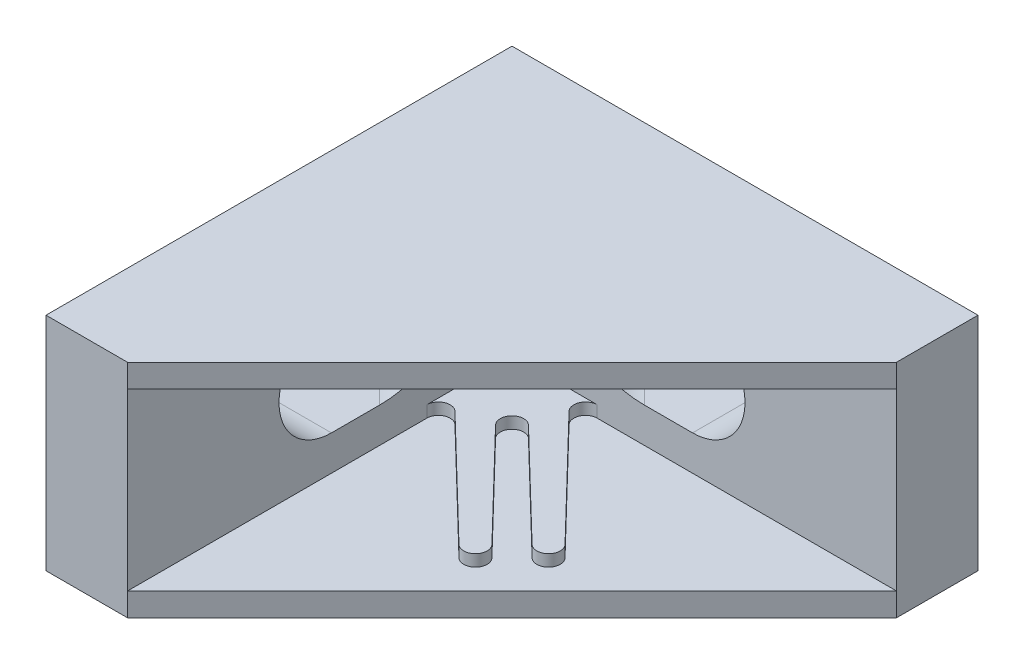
ISO-10303-21;
HEADER;
FILE_DESCRIPTION(('STEP AP214'),'2;1');
FILE_NAME('part.step','',(''),(''),'','','');
FILE_SCHEMA(('AUTOMOTIVE_DESIGN { 1 0 10303 214 1 1 1 1 }'));
ENDSEC;
DATA;
#1=APPLICATION_CONTEXT('core data for automotive mechanical design processes');
#2=APPLICATION_PROTOCOL_DEFINITION('international standard','automotive_design',2000,#1);
#3=PRODUCT_CONTEXT('',#1,'mechanical');
#4=PRODUCT('Part','Part','',(#3));
#5=PRODUCT_RELATED_PRODUCT_CATEGORY('part','',(#4));
#6=PRODUCT_DEFINITION_FORMATION('','',#4);
#7=PRODUCT_DEFINITION_CONTEXT('part definition',#1,'design');
#8=PRODUCT_DEFINITION('design','',#6,#7);
#9=PRODUCT_DEFINITION_SHAPE('','',#8);
#10=(LENGTH_UNIT() NAMED_UNIT(*) SI_UNIT(.MILLI.,.METRE.));
#11=(NAMED_UNIT(*) PLANE_ANGLE_UNIT() SI_UNIT($,.RADIAN.));
#12=(NAMED_UNIT(*) SI_UNIT($,.STERADIAN.) SOLID_ANGLE_UNIT());
#13=UNCERTAINTY_MEASURE_WITH_UNIT(LENGTH_MEASURE(1.E-05),#10,'distance_accuracy_value','');
#14=(GEOMETRIC_REPRESENTATION_CONTEXT(3) GLOBAL_UNCERTAINTY_ASSIGNED_CONTEXT((#13)) GLOBAL_UNIT_ASSIGNED_CONTEXT((#10,
#11,#12)) REPRESENTATION_CONTEXT('',''));
#15=CARTESIAN_POINT('',(0.,0.,0.));
#16=DIRECTION('',(0.,0.,1.));
#17=DIRECTION('',(1.,0.,0.));
#18=AXIS2_PLACEMENT_3D('',#15,#16,#17);
#19=CARTESIAN_POINT('',(14.3108336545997,7.49999999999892,8.00000000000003));
#20=DIRECTION('',(0.,-1.,0.));
#21=DIRECTION('',(0.,0.,-1.));
#22=AXIS2_PLACEMENT_3D('',#19,#20,#21);
#23=CYLINDRICAL_SURFACE('',#22,1.);
#24=DIRECTION('',(0.,-1.,0.));
#25=VECTOR('',#24,1.);
#26=CARTESIAN_POINT('',(14.3108336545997,7.49999999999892,7.00000000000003));
#27=LINE('',#26,#25);
#28=CARTESIAN_POINT('',(14.3108336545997,7.49999999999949,7.00000000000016));
#29=VERTEX_POINT('',#28);
#30=CARTESIAN_POINT('',(14.3108336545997,6.49999999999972,7.00000000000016));
#31=VERTEX_POINT('',#30);
#32=EDGE_CURVE('E360',#29,#31,#27,.T.);
#33=ORIENTED_EDGE('',*,*,#32,.F.);
#34=CARTESIAN_POINT('',(14.3108336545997,7.50000000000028,8.00000000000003));
#35=DIRECTION('',(0.,-1.,0.));
#36=DIRECTION('',(0.,0.,-1.));
#37=AXIS2_PLACEMENT_3D('',#34,#35,#36);
#38=CIRCLE('',#37,1.);
#39=CARTESIAN_POINT('',(13.5914938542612,7.50000000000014,8.69465837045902));
#40=VERTEX_POINT('',#39);
#41=EDGE_CURVE('E427',#29,#40,#38,.F.);
#42=ORIENTED_EDGE('',*,*,#41,.T.);
#43=DIRECTION('',(0.,1.,0.));
#44=VECTOR('',#43,1.);
#45=CARTESIAN_POINT('',(13.5914938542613,7.50000000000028,8.69465837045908));
#46=LINE('',#45,#44);
#47=CARTESIAN_POINT('',(13.5914938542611,6.49999999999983,8.69465837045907));
#48=VERTEX_POINT('',#47);
#49=EDGE_CURVE('E357',#48,#40,#46,.T.);
#50=ORIENTED_EDGE('',*,*,#49,.F.);
#51=CARTESIAN_POINT('',(14.3108336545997,6.4999999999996,8.00000000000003));
#52=DIRECTION('',(0.,-1.,0.));
#53=DIRECTION('',(0.,0.,-1.));
#54=AXIS2_PLACEMENT_3D('',#51,#52,#53);
#55=CIRCLE('',#54,1.);
#56=EDGE_CURVE('E441',#48,#31,#55,.T.);
#57=ORIENTED_EDGE('',*,*,#56,.T.);
#58=EDGE_LOOP('',(#33,#42,#50,#57));
#59=FACE_BOUND('',#58,.T.);
#60=ADVANCED_FACE('F15',(#59),#23,.F.);
#61=CARTESIAN_POINT('',(23.3131774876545,7.50000000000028,18.7617564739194));
#62=DIRECTION('',(0.719339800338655,0.,-0.694658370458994));
#63=DIRECTION('',(-0.694658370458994,0.,-0.719339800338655));
#64=AXIS2_PLACEMENT_3D('',#61,#62,#63);
#65=PLANE('',#64);
#66=DIRECTION('',(0.694658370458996,0.,0.719339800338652));
#67=VECTOR('',#66,1.);
#68=CARTESIAN_POINT('',(13.5914938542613,7.5,8.69465837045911));
#69=LINE('',#68,#67);
#70=CARTESIAN_POINT('',(23.3131774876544,7.50000000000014,18.7617564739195));
#71=VERTEX_POINT('',#70);
#72=EDGE_CURVE('E426',#40,#71,#69,.T.);
#73=ORIENTED_EDGE('',*,*,#72,.T.);
#74=DIRECTION('',(0.,-1.,0.));
#75=VECTOR('',#74,1.);
#76=CARTESIAN_POINT('',(23.3131774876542,7.50000000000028,18.7617564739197));
#77=LINE('',#76,#75);
#78=CARTESIAN_POINT('',(23.3131774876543,6.50000000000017,18.7617564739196));
#79=VERTEX_POINT('',#78);
#80=EDGE_CURVE('E354',#79,#71,#77,.F.);
#81=ORIENTED_EDGE('',*,*,#80,.F.);
#82=DIRECTION('',(-0.694658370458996,0.,-0.719339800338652));
#83=VECTOR('',#82,1.);
#84=CARTESIAN_POINT('',(23.3131774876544,6.50000000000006,18.7617564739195));
#85=LINE('',#84,#83);
#86=EDGE_CURVE('E444',#79,#48,#85,.T.);
#87=ORIENTED_EDGE('',*,*,#86,.T.);
#88=ORIENTED_EDGE('',*,*,#49,.T.);
#89=EDGE_LOOP('',(#73,#81,#87,#88));
#90=FACE_BOUND('',#89,.T.);
#91=ADVANCED_FACE('F541',(#90),#65,.T.);
#92=CARTESIAN_POINT('',(22.5938376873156,7.50000000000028,19.4564148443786));
#93=DIRECTION('',(0.,-1.,0.));
#94=DIRECTION('',(0.,0.,-1.));
#95=AXIS2_PLACEMENT_3D('',#92,#93,#94);
#96=CYLINDRICAL_SURFACE('',#95,1.);
#97=CARTESIAN_POINT('',(22.5938376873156,7.50000000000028,19.4564148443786));
#98=DIRECTION('',(0.,-1.,0.));
#99=DIRECTION('',(0.,0.,-1.));
#100=AXIS2_PLACEMENT_3D('',#97,#98,#99);
#101=CIRCLE('',#100,1.);
#102=CARTESIAN_POINT('',(21.8991793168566,7.50000000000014,20.1757546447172));
#103=VERTEX_POINT('',#102);
#104=EDGE_CURVE('E424',#71,#103,#101,.T.);
#105=ORIENTED_EDGE('',*,*,#104,.T.);
#106=DIRECTION('',(0.,1.,0.));
#107=VECTOR('',#106,1.);
#108=CARTESIAN_POINT('',(21.8991793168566,7.50000000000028,20.1757546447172));
#109=LINE('',#108,#107);
#110=CARTESIAN_POINT('',(21.8991793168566,6.50000000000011,20.1757546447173));
#111=VERTEX_POINT('',#110);
#112=EDGE_CURVE('E351',#111,#103,#109,.T.);
#113=ORIENTED_EDGE('',*,*,#112,.F.);
#114=CARTESIAN_POINT('',(22.5938376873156,6.50000000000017,19.4564148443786));
#115=DIRECTION('',(0.,-1.,0.));
#116=DIRECTION('',(0.,0.,-1.));
#117=AXIS2_PLACEMENT_3D('',#114,#115,#116);
#118=CIRCLE('',#117,1.);
#119=EDGE_CURVE('E445',#111,#79,#118,.F.);
#120=ORIENTED_EDGE('',*,*,#119,.T.);
#121=ORIENTED_EDGE('',*,*,#80,.T.);
#122=EDGE_LOOP('',(#105,#113,#120,#121));
#123=FACE_BOUND('',#122,.T.);
#124=ADVANCED_FACE('F545',(#123),#96,.T.);
#125=CARTESIAN_POINT('',(12.8809498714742,7.50000000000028,11.4669517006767));
#126=DIRECTION('',(-0.694658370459,0.,0.719339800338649));
#127=DIRECTION('',(0.719339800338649,0.,0.694658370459));
#128=AXIS2_PLACEMENT_3D('',#125,#126,#127);
#129=PLANE('',#128);
#130=DIRECTION('',(-0.719339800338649,0.,-0.694658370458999));
#131=VECTOR('',#130,1.);
#132=CARTESIAN_POINT('',(21.8991793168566,7.5,20.1757546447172));
#133=LINE('',#132,#131);
#134=CARTESIAN_POINT('',(12.8809498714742,7.50000000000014,11.4669517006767));
#135=VERTEX_POINT('',#134);
#136=EDGE_CURVE('E423',#103,#135,#133,.T.);
#137=ORIENTED_EDGE('',*,*,#136,.T.);
#138=DIRECTION('',(0.,-1.,0.));
#139=VECTOR('',#138,1.);
#140=CARTESIAN_POINT('',(12.8809498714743,7.50000000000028,11.4669517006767));
#141=LINE('',#140,#139);
#142=CARTESIAN_POINT('',(12.8809498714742,6.49999999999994,11.4669517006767));
#143=VERTEX_POINT('',#142);
#144=EDGE_CURVE('E349',#135,#143,#141,.T.);
#145=ORIENTED_EDGE('',*,*,#144,.T.);
#146=DIRECTION('',(0.719339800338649,0.,0.694658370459));
#147=VECTOR('',#146,1.);
#148=CARTESIAN_POINT('',(12.8809498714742,6.50000000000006,11.4669517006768));
#149=LINE('',#148,#147);
#150=EDGE_CURVE('E429',#143,#111,#149,.T.);
#151=ORIENTED_EDGE('',*,*,#150,.T.);
#152=ORIENTED_EDGE('',*,*,#112,.T.);
#153=EDGE_LOOP('',(#137,#145,#151,#152));
#154=FACE_BOUND('',#153,.T.);
#155=ADVANCED_FACE('F549',(#154),#129,.T.);
#156=CARTESIAN_POINT('',(12.1862915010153,7.50000000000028,12.1862915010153));
#157=DIRECTION('',(0.,-1.,0.));
#158=DIRECTION('',(0.,0.,-1.));
#159=AXIS2_PLACEMENT_3D('',#156,#157,#158);
#160=CYLINDRICAL_SURFACE('',#159,1.);
#161=ORIENTED_EDGE('',*,*,#144,.F.);
#162=CARTESIAN_POINT('',(12.1862915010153,7.50000000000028,12.1862915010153));
#163=DIRECTION('',(0.,-1.,0.));
#164=DIRECTION('',(0.,0.,-1.));
#165=AXIS2_PLACEMENT_3D('',#162,#163,#164);
#166=CIRCLE('',#165,1.);
#167=CARTESIAN_POINT('',(11.4669517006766,7.50000000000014,12.8809498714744));
#168=VERTEX_POINT('',#167);
#169=EDGE_CURVE('E421',#135,#168,#166,.F.);
#170=ORIENTED_EDGE('',*,*,#169,.T.);
#171=DIRECTION('',(0.,1.,0.));
#172=VECTOR('',#171,1.);
#173=CARTESIAN_POINT('',(11.4669517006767,7.50000000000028,12.8809498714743));
#174=LINE('',#173,#172);
#175=CARTESIAN_POINT('',(11.4669517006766,6.49999999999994,12.8809498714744));
#176=VERTEX_POINT('',#175);
#177=EDGE_CURVE('E346',#176,#168,#174,.T.);
#178=ORIENTED_EDGE('',*,*,#177,.F.);
#179=CARTESIAN_POINT('',(12.1862915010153,6.49999999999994,12.1862915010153));
#180=DIRECTION('',(0.,-1.,0.));
#181=DIRECTION('',(0.,0.,-1.));
#182=AXIS2_PLACEMENT_3D('',#179,#180,#181);
#183=CIRCLE('',#182,1.);
#184=EDGE_CURVE('E430',#176,#143,#183,.T.);
#185=ORIENTED_EDGE('',*,*,#184,.T.);
#186=EDGE_LOOP('',(#161,#170,#178,#185));
#187=FACE_BOUND('',#186,.T.);
#188=ADVANCED_FACE('F553',(#187),#160,.F.);
#189=CARTESIAN_POINT('',(20.1757546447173,7.50000000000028,21.8991793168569));
#190=DIRECTION('',(0.71933980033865,0.,-0.694658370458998));
#191=DIRECTION('',(-0.694658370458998,0.,-0.71933980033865));
#192=AXIS2_PLACEMENT_3D('',#189,#190,#191);
#193=PLANE('',#192);
#194=DIRECTION('',(0.694658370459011,0.,0.719339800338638));
#195=VECTOR('',#194,1.);
#196=CARTESIAN_POINT('',(11.4669517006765,7.5,12.8809498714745));
#197=LINE('',#196,#195);
#198=CARTESIAN_POINT('',(20.1757546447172,7.50000000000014,21.8991793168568));
#199=VERTEX_POINT('',#198);
#200=EDGE_CURVE('E420',#168,#199,#197,.T.);
#201=ORIENTED_EDGE('',*,*,#200,.T.);
#202=DIRECTION('',(0.,-1.,0.));
#203=VECTOR('',#202,1.);
#204=CARTESIAN_POINT('',(20.1757546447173,7.50000000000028,21.8991793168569));
#205=LINE('',#204,#203);
#206=CARTESIAN_POINT('',(20.1757546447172,6.50000000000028,21.8991793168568));
#207=VERTEX_POINT('',#206);
#208=EDGE_CURVE('E343',#207,#199,#205,.F.);
#209=ORIENTED_EDGE('',*,*,#208,.F.);
#210=DIRECTION('',(-0.694658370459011,0.,-0.719339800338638));
#211=VECTOR('',#210,1.);
#212=CARTESIAN_POINT('',(20.1757546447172,6.50000000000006,21.8991793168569));
#213=LINE('',#212,#211);
#214=EDGE_CURVE('E433',#207,#176,#213,.T.);
#215=ORIENTED_EDGE('',*,*,#214,.T.);
#216=ORIENTED_EDGE('',*,*,#177,.T.);
#217=EDGE_LOOP('',(#201,#209,#215,#216));
#218=FACE_BOUND('',#217,.T.);
#219=ADVANCED_FACE('F558',(#218),#193,.T.);
#220=CARTESIAN_POINT('',(19.4564148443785,7.50000000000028,22.5938376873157));
#221=DIRECTION('',(0.,-1.,0.));
#222=DIRECTION('',(0.,0.,-1.));
#223=AXIS2_PLACEMENT_3D('',#220,#221,#222);
#224=CYLINDRICAL_SURFACE('',#223,1.);
#225=CARTESIAN_POINT('',(19.4564148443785,7.50000000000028,22.5938376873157));
#226=DIRECTION('',(0.,-1.,0.));
#227=DIRECTION('',(0.,0.,-1.));
#228=AXIS2_PLACEMENT_3D('',#225,#226,#227);
#229=CIRCLE('',#228,1.);
#230=CARTESIAN_POINT('',(18.7617564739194,7.50000000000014,23.3131774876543));
#231=VERTEX_POINT('',#230);
#232=EDGE_CURVE('E418',#199,#231,#229,.T.);
#233=ORIENTED_EDGE('',*,*,#232,.T.);
#234=DIRECTION('',(0.,1.,0.));
#235=VECTOR('',#234,1.);
#236=CARTESIAN_POINT('',(18.7617564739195,7.50000000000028,23.3131774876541));
#237=LINE('',#236,#235);
#238=CARTESIAN_POINT('',(18.7617564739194,6.50000000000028,23.3131774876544));
#239=VERTEX_POINT('',#238);
#240=EDGE_CURVE('E339',#239,#231,#237,.T.);
#241=ORIENTED_EDGE('',*,*,#240,.F.);
#242=CARTESIAN_POINT('',(19.4564148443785,6.50000000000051,22.5938376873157));
#243=DIRECTION('',(0.,-1.,0.));
#244=DIRECTION('',(0.,0.,-1.));
#245=AXIS2_PLACEMENT_3D('',#242,#243,#244);
#246=CIRCLE('',#245,1.);
#247=EDGE_CURVE('E434',#239,#207,#246,.F.);
#248=ORIENTED_EDGE('',*,*,#247,.T.);
#249=ORIENTED_EDGE('',*,*,#208,.T.);
#250=EDGE_LOOP('',(#233,#241,#248,#249));
#251=FACE_BOUND('',#250,.T.);
#252=ADVANCED_FACE('F562',(#251),#224,.T.);
#253=CARTESIAN_POINT('',(8.69465837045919,7.50000000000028,13.591493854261));
#254=DIRECTION('',(-0.694658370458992,0.,0.719339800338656));
#255=DIRECTION('',(0.719339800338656,0.,0.694658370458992));
#256=AXIS2_PLACEMENT_3D('',#253,#254,#255);
#257=PLANE('',#256);
#258=DIRECTION('',(-0.719339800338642,0.,-0.694658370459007));
#259=VECTOR('',#258,1.);
#260=CARTESIAN_POINT('',(18.7617564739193,7.5,23.3131774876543));
#261=LINE('',#260,#259);
#262=CARTESIAN_POINT('',(8.69465837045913,7.50000000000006,13.5914938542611));
#263=VERTEX_POINT('',#262);
#264=EDGE_CURVE('E417',#231,#263,#261,.T.);
#265=ORIENTED_EDGE('',*,*,#264,.T.);
#266=DIRECTION('',(0.,-1.,0.));
#267=VECTOR('',#266,1.);
#268=CARTESIAN_POINT('',(8.69465837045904,7.50000000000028,13.5914938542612));
#269=LINE('',#268,#267);
#270=CARTESIAN_POINT('',(8.6946583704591,6.50000000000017,13.5914938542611));
#271=VERTEX_POINT('',#270);
#272=EDGE_CURVE('E331',#263,#271,#269,.T.);
#273=ORIENTED_EDGE('',*,*,#272,.T.);
#274=DIRECTION('',(0.719339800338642,0.,0.694658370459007));
#275=VECTOR('',#274,1.);
#276=CARTESIAN_POINT('',(8.69465837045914,6.50000000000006,13.5914938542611));
#277=LINE('',#276,#275);
#278=EDGE_CURVE('E437',#271,#239,#277,.T.);
#279=ORIENTED_EDGE('',*,*,#278,.T.);
#280=ORIENTED_EDGE('',*,*,#240,.T.);
#281=EDGE_LOOP('',(#265,#273,#279,#280));
#282=FACE_BOUND('',#281,.T.);
#283=ADVANCED_FACE('F565',(#282),#257,.T.);
#284=CARTESIAN_POINT('',(8.00000000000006,7.50000000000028,14.3108336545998));
#285=DIRECTION('',(0.,-1.,0.));
#286=DIRECTION('',(0.,0.,-1.));
#287=AXIS2_PLACEMENT_3D('',#284,#285,#286);
#288=CYLINDRICAL_SURFACE('',#287,1.);
#289=ORIENTED_EDGE('',*,*,#272,.F.);
#290=CARTESIAN_POINT('',(8.00000000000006,7.50000000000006,14.3108336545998));
#291=DIRECTION('',(0.,-1.,0.));
#292=DIRECTION('',(0.,0.,-1.));
#293=AXIS2_PLACEMENT_3D('',#290,#291,#292);
#294=CIRCLE('',#293,1.);
#295=CARTESIAN_POINT('',(7.00000000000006,7.50000000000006,14.3108336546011));
#296=VERTEX_POINT('',#295);
#297=EDGE_CURVE('E413',#263,#296,#294,.F.);
#298=ORIENTED_EDGE('',*,*,#297,.T.);
#299=DIRECTION('',(0.,-1.,0.));
#300=VECTOR('',#299,1.);
#301=CARTESIAN_POINT('',(7.00000000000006,7.50000000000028,14.3108336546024));
#302=LINE('',#301,#300);
#303=CARTESIAN_POINT('',(7.00000000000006,6.5,14.3108336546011));
#304=VERTEX_POINT('',#303);
#305=EDGE_CURVE('E337',#304,#296,#302,.F.);
#306=ORIENTED_EDGE('',*,*,#305,.F.);
#307=CARTESIAN_POINT('',(8.00000000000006,6.50000000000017,14.3108336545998));
#308=DIRECTION('',(0.,-1.,0.));
#309=DIRECTION('',(0.,0.,-1.));
#310=AXIS2_PLACEMENT_3D('',#307,#308,#309);
#311=CIRCLE('',#310,1.);
#312=EDGE_CURVE('E438',#304,#271,#311,.T.);
#313=ORIENTED_EDGE('',*,*,#312,.T.);
#314=EDGE_LOOP('',(#289,#298,#306,#313));
#315=FACE_BOUND('',#314,.T.);
#316=ADVANCED_FACE('F573',(#315),#288,.F.);
#317=CARTESIAN_POINT('',(7.99999999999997,-7.00000000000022,14.3108336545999));
#318=DIRECTION('',(0.,-1.,0.));
#319=DIRECTION('',(1.,0.,0.));
#320=AXIS2_PLACEMENT_3D('',#317,#318,#319);
#321=CYLINDRICAL_SURFACE('',#320,1.);
#322=DIRECTION('',(0.,-1.,0.));
#323=VECTOR('',#322,1.);
#324=CARTESIAN_POINT('',(6.99999999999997,-7.00000000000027,14.3108336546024));
#325=LINE('',#324,#323);
#326=CARTESIAN_POINT('',(7.00000000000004,-7.50000000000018,14.3108336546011));
#327=VERTEX_POINT('',#326);
#328=CARTESIAN_POINT('',(7.,-6.50000000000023,14.3108336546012));
#329=VERTEX_POINT('',#328);
#330=EDGE_CURVE('E319',#327,#329,#325,.F.);
#331=ORIENTED_EDGE('',*,*,#330,.F.);
#332=CARTESIAN_POINT('',(8.,-7.50000000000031,14.3108336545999));
#333=DIRECTION('',(0.,-1.,0.));
#334=DIRECTION('',(1.,0.,0.));
#335=AXIS2_PLACEMENT_3D('',#332,#333,#334);
#336=CIRCLE('',#335,1.);
#337=CARTESIAN_POINT('',(8.69465837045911,-7.50000000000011,13.5914938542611));
#338=VERTEX_POINT('',#337);
#339=EDGE_CURVE('E402',#338,#327,#336,.F.);
#340=ORIENTED_EDGE('',*,*,#339,.F.);
#341=DIRECTION('',(0.,1.,0.));
#342=VECTOR('',#341,1.);
#343=CARTESIAN_POINT('',(8.69465837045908,-7.50000000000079,13.591493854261));
#344=LINE('',#343,#342);
#345=CARTESIAN_POINT('',(8.69465837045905,-6.49999999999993,13.5914938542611));
#346=VERTEX_POINT('',#345);
#347=EDGE_CURVE('E305',#346,#338,#344,.F.);
#348=ORIENTED_EDGE('',*,*,#347,.F.);
#349=CARTESIAN_POINT('',(7.99999999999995,-6.50000000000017,14.3108336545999));
#350=DIRECTION('',(0.,-1.,0.));
#351=DIRECTION('',(1.,0.,0.));
#352=AXIS2_PLACEMENT_3D('',#349,#350,#351);
#353=CIRCLE('',#352,1.);
#354=EDGE_CURVE('E454',#346,#329,#353,.F.);
#355=ORIENTED_EDGE('',*,*,#354,.T.);
#356=EDGE_LOOP('',(#331,#340,#348,#355));
#357=FACE_BOUND('',#356,.T.);
#358=ADVANCED_FACE('F881',(#357),#321,.F.);
#359=CARTESIAN_POINT('',(14.3108336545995,-6.9999999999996,8.));
#360=DIRECTION('',(0.,-1.,0.));
#361=DIRECTION('',(0.,0.,-1.));
#362=AXIS2_PLACEMENT_3D('',#359,#360,#361);
#363=CYLINDRICAL_SURFACE('',#362,1.);
#364=DIRECTION('',(0.,1.,0.));
#365=VECTOR('',#364,1.);
#366=CARTESIAN_POINT('',(13.5914938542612,-7.5000000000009,8.694658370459));
#367=LINE('',#366,#365);
#368=CARTESIAN_POINT('',(13.591493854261,-7.49999999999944,8.69465837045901));
#369=VERTEX_POINT('',#368);
#370=CARTESIAN_POINT('',(13.591493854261,-6.49999999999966,8.69465837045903));
#371=VERTEX_POINT('',#370);
#372=EDGE_CURVE('E316',#369,#371,#367,.T.);
#373=ORIENTED_EDGE('',*,*,#372,.F.);
#374=CARTESIAN_POINT('',(14.3108336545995,-7.4999999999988,7.99999999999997));
#375=DIRECTION('',(0.,-1.,0.));
#376=DIRECTION('',(0.,0.,-1.));
#377=AXIS2_PLACEMENT_3D('',#374,#375,#376);
#378=CIRCLE('',#377,1.);
#379=CARTESIAN_POINT('',(14.3108336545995,-7.49999999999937,7.00000000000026));
#380=VERTEX_POINT('',#379);
#381=EDGE_CURVE('E398',#380,#369,#378,.F.);
#382=ORIENTED_EDGE('',*,*,#381,.F.);
#383=DIRECTION('',(0.,1.,0.));
#384=VECTOR('',#383,1.);
#385=CARTESIAN_POINT('',(14.3108336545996,0.,7.0000000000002));
#386=LINE('',#385,#384);
#387=CARTESIAN_POINT('',(14.3108336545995,-6.49999999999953,7.0000000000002));
#388=VERTEX_POINT('',#387);
#389=EDGE_CURVE('E320',#380,#388,#386,.T.);
#390=ORIENTED_EDGE('',*,*,#389,.T.);
#391=CARTESIAN_POINT('',(14.3108336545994,-6.49999999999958,8.00000000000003));
#392=DIRECTION('',(0.,-1.,0.));
#393=DIRECTION('',(0.,0.,-1.));
#394=AXIS2_PLACEMENT_3D('',#391,#392,#393);
#395=CIRCLE('',#394,1.);
#396=EDGE_CURVE('E452',#388,#371,#395,.F.);
#397=ORIENTED_EDGE('',*,*,#396,.T.);
#398=EDGE_LOOP('',(#373,#382,#390,#397));
#399=FACE_BOUND('',#398,.T.);
#400=ADVANCED_FACE('F889',(#399),#363,.F.);
#401=CARTESIAN_POINT('',(18.4523356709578,-7.5000000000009,13.7282074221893));
#402=DIRECTION('',(0.719339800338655,0.,-0.694658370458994));
#403=DIRECTION('',(-0.694658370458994,0.,-0.719339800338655));
#404=AXIS2_PLACEMENT_3D('',#401,#402,#403);
#405=PLANE('',#404);
#406=DIRECTION('',(0.694658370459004,0.,0.719339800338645));
#407=VECTOR('',#406,1.);
#408=CARTESIAN_POINT('',(13.591493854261,-7.5,8.69465837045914));
#409=LINE('',#408,#407);
#410=CARTESIAN_POINT('',(23.3131774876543,-7.50000000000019,18.7617564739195));
#411=VERTEX_POINT('',#410);
#412=EDGE_CURVE('E397',#369,#411,#409,.T.);
#413=ORIENTED_EDGE('',*,*,#412,.F.);
#414=ORIENTED_EDGE('',*,*,#372,.T.);
#415=DIRECTION('',(0.694658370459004,0.,0.719339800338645));
#416=VECTOR('',#415,1.);
#417=CARTESIAN_POINT('',(13.591493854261,-6.49999999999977,8.69465837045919));
#418=LINE('',#417,#416);
#419=CARTESIAN_POINT('',(23.3131774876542,-6.5,18.7617564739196));
#420=VERTEX_POINT('',#419);
#421=EDGE_CURVE('E451',#371,#420,#418,.T.);
#422=ORIENTED_EDGE('',*,*,#421,.T.);
#423=DIRECTION('',(0.,-1.,0.));
#424=VECTOR('',#423,1.);
#425=CARTESIAN_POINT('',(23.3131774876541,-7.0000000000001,18.7617564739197));
#426=LINE('',#425,#424);
#427=EDGE_CURVE('E313',#411,#420,#426,.F.);
#428=ORIENTED_EDGE('',*,*,#427,.F.);
#429=EDGE_LOOP('',(#413,#414,#422,#428));
#430=FACE_BOUND('',#429,.T.);
#431=ADVANCED_FACE('F479',(#430),#405,.T.);
#432=CARTESIAN_POINT('',(22.5938376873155,-7.00000000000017,19.4564148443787));
#433=DIRECTION('',(0.,-1.,0.));
#434=DIRECTION('',(1.,0.,0.));
#435=AXIS2_PLACEMENT_3D('',#432,#433,#434);
#436=CYLINDRICAL_SURFACE('',#435,1.);
#437=CARTESIAN_POINT('',(22.5938376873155,-7.50000000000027,19.4564148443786));
#438=DIRECTION('',(0.,-1.,0.));
#439=DIRECTION('',(1.,0.,0.));
#440=AXIS2_PLACEMENT_3D('',#437,#438,#439);
#441=CIRCLE('',#440,1.);
#442=CARTESIAN_POINT('',(21.8991793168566,-7.50000000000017,20.1757546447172));
#443=VERTEX_POINT('',#442);
#444=EDGE_CURVE('E394',#411,#443,#441,.T.);
#445=ORIENTED_EDGE('',*,*,#444,.F.);
#446=ORIENTED_EDGE('',*,*,#427,.T.);
#447=CARTESIAN_POINT('',(22.5938376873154,-6.50000000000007,19.4564148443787));
#448=DIRECTION('',(0.,-1.,0.));
#449=DIRECTION('',(1.,0.,0.));
#450=AXIS2_PLACEMENT_3D('',#447,#448,#449);
#451=CIRCLE('',#450,1.);
#452=CARTESIAN_POINT('',(21.8991793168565,-6.49999999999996,20.1757546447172));
#453=VERTEX_POINT('',#452);
#454=EDGE_CURVE('E449',#420,#453,#451,.T.);
#455=ORIENTED_EDGE('',*,*,#454,.T.);
#456=DIRECTION('',(0.,1.,0.));
#457=VECTOR('',#456,1.);
#458=CARTESIAN_POINT('',(21.8991793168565,-7.50000000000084,20.1757546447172));
#459=LINE('',#458,#457);
#460=EDGE_CURVE('E310',#443,#453,#459,.T.);
#461=ORIENTED_EDGE('',*,*,#460,.F.);
#462=EDGE_LOOP('',(#445,#446,#455,#461));
#463=FACE_BOUND('',#462,.T.);
#464=ADVANCED_FACE('F482',(#463),#436,.T.);
#465=CARTESIAN_POINT('',(17.3900645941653,-7.50000000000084,15.821353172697));
#466=DIRECTION('',(-0.694658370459,0.,0.719339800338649));
#467=DIRECTION('',(0.719339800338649,0.,0.694658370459));
#468=AXIS2_PLACEMENT_3D('',#465,#466,#467);
#469=PLANE('',#468);
#470=DIRECTION('',(-0.719339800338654,0.,-0.694658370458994));
#471=VECTOR('',#470,1.);
#472=CARTESIAN_POINT('',(21.8991793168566,-7.5,20.1757546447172));
#473=LINE('',#472,#471);
#474=CARTESIAN_POINT('',(12.8809498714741,-7.50000000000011,11.4669517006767));
#475=VERTEX_POINT('',#474);
#476=EDGE_CURVE('E393',#443,#475,#473,.T.);
#477=ORIENTED_EDGE('',*,*,#476,.F.);
#478=ORIENTED_EDGE('',*,*,#460,.T.);
#479=DIRECTION('',(-0.719339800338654,0.,-0.694658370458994));
#480=VECTOR('',#479,1.);
#481=CARTESIAN_POINT('',(21.8991793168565,-6.49999999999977,20.1757546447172));
#482=LINE('',#481,#480);
#483=CARTESIAN_POINT('',(12.880949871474,-6.4999999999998,11.4669517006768));
#484=VERTEX_POINT('',#483);
#485=EDGE_CURVE('E448',#453,#484,#482,.T.);
#486=ORIENTED_EDGE('',*,*,#485,.T.);
#487=DIRECTION('',(0.,-1.,0.));
#488=VECTOR('',#487,1.);
#489=CARTESIAN_POINT('',(12.8809498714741,-7.00000000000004,11.4669517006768));
#490=LINE('',#489,#488);
#491=EDGE_CURVE('E245',#484,#475,#490,.T.);
#492=ORIENTED_EDGE('',*,*,#491,.T.);
#493=EDGE_LOOP('',(#477,#478,#486,#492));
#494=FACE_BOUND('',#493,.T.);
#495=ADVANCED_FACE('F486',(#494),#469,.T.);
#496=CARTESIAN_POINT('',(12.1862915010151,-7.00000000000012,12.1862915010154));
#497=DIRECTION('',(0.,-1.,0.));
#498=DIRECTION('',(0.,0.,-1.));
#499=AXIS2_PLACEMENT_3D('',#496,#497,#498);
#500=CYLINDRICAL_SURFACE('',#499,1.);
#501=DIRECTION('',(0.,1.,0.));
#502=VECTOR('',#501,1.);
#503=CARTESIAN_POINT('',(11.4669517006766,-7.50000000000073,12.8809498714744));
#504=LINE('',#503,#502);
#505=CARTESIAN_POINT('',(11.4669517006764,-7.50000000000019,12.8809498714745));
#506=VERTEX_POINT('',#505);
#507=CARTESIAN_POINT('',(11.4669517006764,-6.5,12.8809498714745));
#508=VERTEX_POINT('',#507);
#509=EDGE_CURVE('E250',#506,#508,#504,.T.);
#510=ORIENTED_EDGE('',*,*,#509,.F.);
#511=CARTESIAN_POINT('',(12.1862915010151,-7.50000000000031,12.1862915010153));
#512=DIRECTION('',(0.,-1.,0.));
#513=DIRECTION('',(0.,0.,-1.));
#514=AXIS2_PLACEMENT_3D('',#511,#512,#513);
#515=CIRCLE('',#514,1.);
#516=EDGE_CURVE('E391',#475,#506,#515,.F.);
#517=ORIENTED_EDGE('',*,*,#516,.F.);
#518=ORIENTED_EDGE('',*,*,#491,.F.);
#519=CARTESIAN_POINT('',(12.186291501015,-6.49999999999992,12.1862915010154));
#520=DIRECTION('',(0.,-1.,0.));
#521=DIRECTION('',(0.,0.,-1.));
#522=AXIS2_PLACEMENT_3D('',#519,#520,#521);
#523=CIRCLE('',#522,1.);
#524=EDGE_CURVE('E18',#484,#508,#523,.F.);
#525=ORIENTED_EDGE('',*,*,#524,.T.);
#526=EDGE_LOOP('',(#510,#517,#518,#525));
#527=FACE_BOUND('',#526,.T.);
#528=ADVANCED_FACE('F249',(#527),#500,.F.);
#529=CARTESIAN_POINT('',(15.8213531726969,-7.50000000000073,17.3900645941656));
#530=DIRECTION('',(0.719339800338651,0.,-0.694658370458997));
#531=DIRECTION('',(-0.694658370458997,0.,-0.719339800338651));
#532=AXIS2_PLACEMENT_3D('',#529,#530,#531);
#533=PLANE('',#532);
#534=DIRECTION('',(0.694658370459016,0.,0.719339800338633));
#535=VECTOR('',#534,1.);
#536=CARTESIAN_POINT('',(11.4669517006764,-7.5,12.8809498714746));
#537=LINE('',#536,#535);
#538=CARTESIAN_POINT('',(20.175754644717,-7.50000000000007,21.8991793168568));
#539=VERTEX_POINT('',#538);
#540=EDGE_CURVE('E261',#506,#539,#537,.T.);
#541=ORIENTED_EDGE('',*,*,#540,.F.);
#542=ORIENTED_EDGE('',*,*,#509,.T.);
#543=DIRECTION('',(0.694658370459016,0.,0.719339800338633));
#544=VECTOR('',#543,1.);
#545=CARTESIAN_POINT('',(11.4669517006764,-6.49999999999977,12.8809498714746));
#546=LINE('',#545,#544);
#547=CARTESIAN_POINT('',(20.175754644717,-6.5,21.8991793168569));
#548=VERTEX_POINT('',#547);
#549=EDGE_CURVE('E255',#508,#548,#546,.T.);
#550=ORIENTED_EDGE('',*,*,#549,.T.);
#551=DIRECTION('',(0.,-1.,0.));
#552=VECTOR('',#551,1.);
#553=CARTESIAN_POINT('',(20.1757546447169,-7.00000000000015,21.8991793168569));
#554=LINE('',#553,#552);
#555=EDGE_CURVE('E263',#539,#548,#554,.F.);
#556=ORIENTED_EDGE('',*,*,#555,.F.);
#557=EDGE_LOOP('',(#541,#542,#550,#556));
#558=FACE_BOUND('',#557,.T.);
#559=ADVANCED_FACE('F258',(#558),#533,.T.);
#560=CARTESIAN_POINT('',(19.4564148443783,-7.00000000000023,22.593837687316));
#561=DIRECTION('',(0.,-1.,0.));
#562=DIRECTION('',(0.,0.,-1.));
#563=AXIS2_PLACEMENT_3D('',#560,#561,#562);
#564=CYLINDRICAL_SURFACE('',#563,1.);
#565=CARTESIAN_POINT('',(19.4564148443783,-7.50000000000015,22.5938376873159));
#566=DIRECTION('',(0.,-1.,0.));
#567=DIRECTION('',(0.,0.,-1.));
#568=AXIS2_PLACEMENT_3D('',#565,#566,#567);
#569=CIRCLE('',#568,1.);
#570=CARTESIAN_POINT('',(18.7617564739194,-7.50000000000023,23.3131774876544));
#571=VERTEX_POINT('',#570);
#572=EDGE_CURVE('E388',#539,#571,#569,.T.);
#573=ORIENTED_EDGE('',*,*,#572,.F.);
#574=ORIENTED_EDGE('',*,*,#555,.T.);
#575=CARTESIAN_POINT('',(19.4564148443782,-6.50000000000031,22.593837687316));
#576=DIRECTION('',(0.,-1.,0.));
#577=DIRECTION('',(0.,0.,-1.));
#578=AXIS2_PLACEMENT_3D('',#575,#576,#577);
#579=CIRCLE('',#578,1.);
#580=CARTESIAN_POINT('',(18.7617564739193,-6.50000000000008,23.3131774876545));
#581=VERTEX_POINT('',#580);
#582=EDGE_CURVE('E269',#548,#581,#579,.T.);
#583=ORIENTED_EDGE('',*,*,#582,.T.);
#584=DIRECTION('',(0.,1.,0.));
#585=VECTOR('',#584,1.);
#586=CARTESIAN_POINT('',(18.7617564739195,-7.50000000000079,23.3131774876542));
#587=LINE('',#586,#585);
#588=EDGE_CURVE('E256',#571,#581,#587,.T.);
#589=ORIENTED_EDGE('',*,*,#588,.F.);
#590=EDGE_LOOP('',(#573,#574,#583,#589));
#591=FACE_BOUND('',#590,.T.);
#592=ADVANCED_FACE('F608',(#591),#564,.T.);
#593=CARTESIAN_POINT('',(13.7282074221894,-7.50000000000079,18.4523356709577));
#594=DIRECTION('',(-0.694658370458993,0.,0.719339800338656));
#595=DIRECTION('',(0.719339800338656,0.,0.694658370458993));
#596=AXIS2_PLACEMENT_3D('',#593,#594,#595);
#597=PLANE('',#596);
#598=DIRECTION('',(-0.719339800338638,0.,-0.694658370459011));
#599=VECTOR('',#598,1.);
#600=CARTESIAN_POINT('',(18.7617564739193,-7.5,23.3131774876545));
#601=LINE('',#600,#599);
#602=EDGE_CURVE('E293',#571,#338,#601,.T.);
#603=ORIENTED_EDGE('',*,*,#602,.F.);
#604=ORIENTED_EDGE('',*,*,#588,.T.);
#605=DIRECTION('',(-0.719339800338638,0.,-0.694658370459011));
#606=VECTOR('',#605,1.);
#607=CARTESIAN_POINT('',(18.7617564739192,-6.49999999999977,23.3131774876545));
#608=LINE('',#607,#606);
#609=EDGE_CURVE('E271',#581,#346,#608,.T.);
#610=ORIENTED_EDGE('',*,*,#609,.T.);
#611=ORIENTED_EDGE('',*,*,#347,.T.);
#612=EDGE_LOOP('',(#603,#604,#610,#611));
#613=FACE_BOUND('',#612,.T.);
#614=ADVANCED_FACE('F462',(#613),#597,.T.);
#615=CARTESIAN_POINT('',(23.5938376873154,-6.49999999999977,15.296918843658));
#616=DIRECTION('',(0.,-1.,0.));
#617=DIRECTION('',(0.,0.,-1.));
#618=AXIS2_PLACEMENT_3D('',#615,#616,#617);
#619=PLANE('',#618);
#620=ORIENTED_EDGE('',*,*,#454,.F.);
#621=ORIENTED_EDGE('',*,*,#421,.F.);
#622=ORIENTED_EDGE('',*,*,#396,.F.);
#623=DIRECTION('',(-1.,0.,0.));
#624=VECTOR('',#623,1.);
#625=CARTESIAN_POINT('',(19.9999999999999,-6.49999999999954,7.0000000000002));
#626=LINE('',#625,#624);
#627=CARTESIAN_POINT('',(7.00000000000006,-6.5,7.00000000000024));
#628=VERTEX_POINT('',#627);
#629=EDGE_CURVE('E322',#388,#628,#626,.T.);
#630=ORIENTED_EDGE('',*,*,#629,.T.);
#631=DIRECTION('',(0.,0.,-1.));
#632=VECTOR('',#631,1.);
#633=CARTESIAN_POINT('',(7.00000000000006,-6.50000000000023,40.0000000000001));
#634=LINE('',#633,#632);
#635=EDGE_CURVE('E278',#329,#628,#634,.T.);
#636=ORIENTED_EDGE('',*,*,#635,.F.);
#637=ORIENTED_EDGE('',*,*,#354,.F.);
#638=ORIENTED_EDGE('',*,*,#609,.F.);
#639=ORIENTED_EDGE('',*,*,#582,.F.);
#640=ORIENTED_EDGE('',*,*,#549,.F.);
#641=ORIENTED_EDGE('',*,*,#524,.F.);
#642=ORIENTED_EDGE('',*,*,#485,.F.);
#643=EDGE_LOOP('',(#620,#621,#622,#630,#636,#637,#638,#639,#640,#641,#642));
#644=FACE_BOUND('',#643,.T.);
#645=ADVANCED_FACE('F267',(#644),#619,.F.);
#646=CARTESIAN_POINT('',(14.8803351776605,6.50000000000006,14.8803351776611));
#647=DIRECTION('',(0.,1.,0.));
#648=DIRECTION('',(0.,0.,1.));
#649=AXIS2_PLACEMENT_3D('',#646,#647,#648);
#650=PLANE('',#649);
#651=ORIENTED_EDGE('',*,*,#184,.F.);
#652=ORIENTED_EDGE('',*,*,#214,.F.);
#653=ORIENTED_EDGE('',*,*,#247,.F.);
#654=ORIENTED_EDGE('',*,*,#278,.F.);
#655=ORIENTED_EDGE('',*,*,#312,.F.);
#656=DIRECTION('',(0.,0.,-1.));
#657=VECTOR('',#656,1.);
#658=CARTESIAN_POINT('',(7.00000000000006,6.49999999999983,40.0000000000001));
#659=LINE('',#658,#657);
#660=CARTESIAN_POINT('',(7.,6.49999999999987,7.0000000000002));
#661=VERTEX_POINT('',#660);
#662=EDGE_CURVE('E299',#661,#304,#659,.F.);
#663=ORIENTED_EDGE('',*,*,#662,.F.);
#664=DIRECTION('',(-1.,0.,0.));
#665=VECTOR('',#664,1.);
#666=CARTESIAN_POINT('',(19.9999999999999,6.49999999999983,7.0000000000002));
#667=LINE('',#666,#665);
#668=EDGE_CURVE('E412',#661,#31,#667,.F.);
#669=ORIENTED_EDGE('',*,*,#668,.T.);
#670=ORIENTED_EDGE('',*,*,#56,.F.);
#671=ORIENTED_EDGE('',*,*,#86,.F.);
#672=ORIENTED_EDGE('',*,*,#119,.F.);
#673=ORIENTED_EDGE('',*,*,#150,.F.);
#674=EDGE_LOOP('',(#651,#652,#653,#654,#655,#663,#669,#670,#671,#672,#673));
#675=FACE_BOUND('',#674,.T.);
#676=ADVANCED_FACE('F530',(#675),#650,.F.);
#677=CARTESIAN_POINT('',(6.99999999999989,7.5,7.00000000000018));
#678=DIRECTION('',(0.,1.,0.));
#679=DIRECTION('',(0.,0.,1.));
#680=AXIS2_PLACEMENT_3D('',#677,#678,#679);
#681=PLANE('',#680);
#682=ORIENTED_EDGE('',*,*,#264,.F.);
#683=ORIENTED_EDGE('',*,*,#232,.F.);
#684=ORIENTED_EDGE('',*,*,#200,.F.);
#685=ORIENTED_EDGE('',*,*,#169,.F.);
#686=ORIENTED_EDGE('',*,*,#136,.F.);
#687=ORIENTED_EDGE('',*,*,#104,.F.);
#688=ORIENTED_EDGE('',*,*,#72,.F.);
#689=ORIENTED_EDGE('',*,*,#41,.F.);
#690=DIRECTION('',(-1.,0.,0.));
#691=VECTOR('',#690,1.);
#692=CARTESIAN_POINT('',(19.9999999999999,7.49999999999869,7.0000000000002));
#693=LINE('',#692,#691);
#694=CARTESIAN_POINT('',(39.9999999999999,7.49999999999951,7.00000000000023));
#695=VERTEX_POINT('',#694);
#696=EDGE_CURVE('E323',#29,#695,#693,.F.);
#697=ORIENTED_EDGE('',*,*,#696,.T.);
#698=DIRECTION('',(0.707106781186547,0.,-0.707106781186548));
#699=VECTOR('',#698,1.);
#700=CARTESIAN_POINT('',(7.00000000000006,7.5,40.0000000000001));
#701=LINE('',#700,#699);
#702=CARTESIAN_POINT('',(7.00000000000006,7.50000000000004,40.));
#703=VERTEX_POINT('',#702);
#704=EDGE_CURVE('E294',#703,#695,#701,.T.);
#705=ORIENTED_EDGE('',*,*,#704,.F.);
#706=DIRECTION('',(0.,0.,-1.));
#707=VECTOR('',#706,1.);
#708=CARTESIAN_POINT('',(7.00000000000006,7.50000000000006,40.0000000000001));
#709=LINE('',#708,#707);
#710=EDGE_CURVE('E279',#296,#703,#709,.F.);
#711=ORIENTED_EDGE('',*,*,#710,.F.);
#712=ORIENTED_EDGE('',*,*,#297,.F.);
#713=EDGE_LOOP('',(#682,#683,#684,#685,#686,#687,#688,#689,#697,#705,#711,#712));
#714=FACE_BOUND('',#713,.T.);
#715=ADVANCED_FACE('F575',(#714),#681,.F.);
#716=CARTESIAN_POINT('',(16.025126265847,4.5,3.00901306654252));
#717=DIRECTION('',(0.,1.,0.));
#718=DIRECTION('',(0.,0.,1.));
#719=AXIS2_PLACEMENT_3D('',#716,#717,#718);
#720=PLANE('',#719);
#721=DIRECTION('',(0.,0.,-1.));
#722=VECTOR('',#721,1.);
#723=CARTESIAN_POINT('',(22.4999999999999,4.5,3.71404189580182));
#724=LINE('',#723,#722);
#725=CARTESIAN_POINT('',(22.5,4.5,1.00364151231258E-13));
#726=VERTEX_POINT('',#725);
#727=CARTESIAN_POINT('',(22.5,4.5,7.00000000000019));
#728=VERTEX_POINT('',#727);
#729=EDGE_CURVE('E501',#726,#728,#724,.F.);
#730=ORIENTED_EDGE('',*,*,#729,.T.);
#731=DIRECTION('',(-1.,0.,0.));
#732=VECTOR('',#731,1.);
#733=CARTESIAN_POINT('',(19.9999999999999,4.5,7.0000000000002));
#734=LINE('',#733,#732);
#735=CARTESIAN_POINT('',(18.3639610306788,4.5,7.0000000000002));
#736=VERTEX_POINT('',#735);
#737=EDGE_CURVE('E408',#728,#736,#734,.T.);
#738=ORIENTED_EDGE('',*,*,#737,.T.);
#739=DIRECTION('',(-0.707106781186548,0.,-0.707106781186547));
#740=VECTOR('',#739,1.);
#741=CARTESIAN_POINT('',(15.1905153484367,4.5,3.82655431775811));
#742=LINE('',#741,#740);
#743=CARTESIAN_POINT('',(11.3639610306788,4.5,1.79836170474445E-13));
#744=VERTEX_POINT('',#743);
#745=EDGE_CURVE('E416',#736,#744,#742,.T.);
#746=ORIENTED_EDGE('',*,*,#745,.T.);
#747=DIRECTION('',(-1.,0.,0.));
#748=VECTOR('',#747,1.);
#749=CARTESIAN_POINT('',(40.0000000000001,4.5,1.79412E-13));
#750=LINE('',#749,#748);
#751=EDGE_CURVE('E379',#726,#744,#750,.T.);
#752=ORIENTED_EDGE('',*,*,#751,.F.);
#753=EDGE_LOOP('',(#730,#738,#746,#752));
#754=FACE_BOUND('',#753,.T.);
#755=ADVANCED_FACE('F683',(#754),#720,.F.);
#756=CARTESIAN_POINT('',(15.1905153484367,0.,3.82655431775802));
#757=DIRECTION('',(-0.707106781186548,0.,-0.707106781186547));
#758=DIRECTION('',(-0.707106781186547,0.,0.707106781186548));
#759=AXIS2_PLACEMENT_3D('',#756,#757,#758);
#760=CYLINDRICAL_SURFACE('',#759,4.5);
#761=ORIENTED_EDGE('',*,*,#745,.F.);
#762=CARTESIAN_POINT('',(18.3639610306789,0.,7.0000000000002));
#763=DIRECTION('',(0.,0.,-1.));
#764=DIRECTION('',(-1.,0.,0.));
#765=AXIS2_PLACEMENT_3D('',#762,#763,#764);
#766=ELLIPSE('',#765,6.36396103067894,4.5);
#767=CARTESIAN_POINT('',(18.3639610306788,-4.5,7.0000000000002));
#768=VERTEX_POINT('',#767);
#769=EDGE_CURVE('E406',#736,#768,#766,.F.);
#770=ORIENTED_EDGE('',*,*,#769,.T.);
#771=DIRECTION('',(0.707106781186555,0.,0.70710678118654));
#772=VECTOR('',#771,1.);
#773=CARTESIAN_POINT('',(11.3639610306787,-4.5,3.01841884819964E-13));
#774=LINE('',#773,#772);
#775=CARTESIAN_POINT('',(11.3639610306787,-4.5,1.79419542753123E-13));
#776=VERTEX_POINT('',#775);
#777=EDGE_CURVE('E503',#776,#768,#774,.T.);
#778=ORIENTED_EDGE('',*,*,#777,.F.);
#779=CARTESIAN_POINT('',(11.3639610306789,0.,1.795438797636E-13));
#780=DIRECTION('',(0.,0.,-1.));
#781=DIRECTION('',(-1.,0.,0.));
#782=AXIS2_PLACEMENT_3D('',#779,#780,#781);
#783=ELLIPSE('',#782,6.36396103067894,4.5);
#784=EDGE_CURVE('E376',#744,#776,#783,.F.);
#785=ORIENTED_EDGE('',*,*,#784,.F.);
#786=EDGE_LOOP('',(#761,#770,#778,#785));
#787=FACE_BOUND('',#786,.T.);
#788=ADVANCED_FACE('F679',(#787),#760,.F.);
#789=CARTESIAN_POINT('',(16.0251262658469,-4.5,3.00901306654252));
#790=DIRECTION('',(0.,1.,0.));
#791=DIRECTION('',(0.,0.,1.));
#792=AXIS2_PLACEMENT_3D('',#789,#790,#791);
#793=PLANE('',#792);
#794=DIRECTION('',(-1.,0.,0.));
#795=VECTOR('',#794,1.);
#796=CARTESIAN_POINT('',(19.9999999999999,-4.5,7.0000000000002));
#797=LINE('',#796,#795);
#798=CARTESIAN_POINT('',(22.4999999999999,-4.5,7.00000000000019));
#799=VERTEX_POINT('',#798);
#800=EDGE_CURVE('E405',#768,#799,#797,.F.);
#801=ORIENTED_EDGE('',*,*,#800,.T.);
#802=DIRECTION('',(0.,0.,-1.));
#803=VECTOR('',#802,1.);
#804=CARTESIAN_POINT('',(22.4999999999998,-4.5,3.71404189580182));
#805=LINE('',#804,#803);
#806=CARTESIAN_POINT('',(22.4999999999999,-4.5,1.00364151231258E-13));
#807=VERTEX_POINT('',#806);
#808=EDGE_CURVE('E333',#799,#807,#805,.T.);
#809=ORIENTED_EDGE('',*,*,#808,.T.);
#810=DIRECTION('',(-1.,0.,0.));
#811=VECTOR('',#810,1.);
#812=CARTESIAN_POINT('',(40.0000000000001,-4.5,1.79412E-13));
#813=LINE('',#812,#811);
#814=EDGE_CURVE('E375',#776,#807,#813,.F.);
#815=ORIENTED_EDGE('',*,*,#814,.F.);
#816=ORIENTED_EDGE('',*,*,#777,.T.);
#817=EDGE_LOOP('',(#801,#809,#815,#816));
#818=FACE_BOUND('',#817,.T.);
#819=ADVANCED_FACE('F675',(#818),#793,.T.);
#820=CARTESIAN_POINT('',(22.5000000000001,0.,3.71404189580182));
#821=DIRECTION('',(0.,0.,-1.));
#822=DIRECTION('',(-1.,0.,0.));
#823=AXIS2_PLACEMENT_3D('',#820,#821,#822);
#824=CYLINDRICAL_SURFACE('',#823,4.5);
#825=CARTESIAN_POINT('',(22.5000000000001,0.,7.00000000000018));
#826=DIRECTION('',(0.,0.,-1.));
#827=DIRECTION('',(-1.,0.,0.));
#828=AXIS2_PLACEMENT_3D('',#825,#826,#827);
#829=CIRCLE('',#828,4.5);
#830=EDGE_CURVE('E409',#799,#728,#829,.F.);
#831=ORIENTED_EDGE('',*,*,#830,.T.);
#832=ORIENTED_EDGE('',*,*,#729,.F.);
#833=CARTESIAN_POINT('',(22.5000000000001,0.,0.));
#834=DIRECTION('',(0.,0.,-1.));
#835=DIRECTION('',(-1.,0.,0.));
#836=AXIS2_PLACEMENT_3D('',#833,#834,#835);
#837=CIRCLE('',#836,4.5);
#838=EDGE_CURVE('E371',#807,#726,#837,.F.);
#839=ORIENTED_EDGE('',*,*,#838,.F.);
#840=ORIENTED_EDGE('',*,*,#808,.F.);
#841=EDGE_LOOP('',(#831,#832,#839,#840));
#842=FACE_BOUND('',#841,.T.);
#843=ADVANCED_FACE('F671',(#842),#824,.F.);
#844=CARTESIAN_POINT('',(19.9999999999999,0.,7.0000000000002));
#845=DIRECTION('',(0.,0.,-1.));
#846=DIRECTION('',(-1.,0.,0.));
#847=AXIS2_PLACEMENT_3D('',#844,#845,#846);
#848=PLANE('',#847);
#849=ORIENTED_EDGE('',*,*,#769,.F.);
#850=ORIENTED_EDGE('',*,*,#737,.F.);
#851=ORIENTED_EDGE('',*,*,#830,.F.);
#852=ORIENTED_EDGE('',*,*,#800,.F.);
#853=EDGE_LOOP('',(#849,#850,#851,#852));
#854=FACE_BOUND('',#853,.T.);
#855=ORIENTED_EDGE('',*,*,#668,.F.);
#856=DIRECTION('',(0.,1.,0.));
#857=VECTOR('',#856,1.);
#858=CARTESIAN_POINT('',(7.00000000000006,9.5,7.00000000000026));
#859=LINE('',#858,#857);
#860=EDGE_CURVE('E470',#628,#661,#859,.T.);
#861=ORIENTED_EDGE('',*,*,#860,.F.);
#862=ORIENTED_EDGE('',*,*,#629,.F.);
#863=ORIENTED_EDGE('',*,*,#389,.F.);
#864=DIRECTION('',(1.,0.,0.));
#865=VECTOR('',#864,1.);
#866=CARTESIAN_POINT('',(18.,-7.5,7.00000000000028));
#867=LINE('',#866,#865);
#868=CARTESIAN_POINT('',(39.9999999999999,-7.50000000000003,7.00000000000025));
#869=VERTEX_POINT('',#868);
#870=EDGE_CURVE('E401',#869,#380,#867,.F.);
#871=ORIENTED_EDGE('',*,*,#870,.F.);
#872=DIRECTION('',(0.,1.,0.));
#873=VECTOR('',#872,1.);
#874=CARTESIAN_POINT('',(39.9999999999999,-9.50000000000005,7.00000000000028));
#875=LINE('',#874,#873);
#876=EDGE_CURVE('E324',#695,#869,#875,.F.);
#877=ORIENTED_EDGE('',*,*,#876,.F.);
#878=ORIENTED_EDGE('',*,*,#696,.F.);
#879=ORIENTED_EDGE('',*,*,#32,.T.);
#880=EDGE_LOOP('',(#855,#861,#862,#863,#871,#877,#878,#879));
#881=FACE_BOUND('',#880,.T.);
#882=ADVANCED_FACE('F534',(#854,#881),#848,.F.);
#883=CARTESIAN_POINT('',(18.,-7.5,18.));
#884=DIRECTION('',(0.,1.,0.));
#885=DIRECTION('',(0.,0.,1.));
#886=AXIS2_PLACEMENT_3D('',#883,#884,#885);
#887=PLANE('',#886);
#888=ORIENTED_EDGE('',*,*,#572,.T.);
#889=ORIENTED_EDGE('',*,*,#602,.T.);
#890=ORIENTED_EDGE('',*,*,#339,.T.);
#891=DIRECTION('',(0.,0.,-1.));
#892=VECTOR('',#891,1.);
#893=CARTESIAN_POINT('',(7.00000000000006,-7.5,40.0000000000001));
#894=LINE('',#893,#892);
#895=CARTESIAN_POINT('',(7.00000000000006,-7.5,40.0000000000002));
#896=VERTEX_POINT('',#895);
#897=EDGE_CURVE('E275',#896,#327,#894,.T.);
#898=ORIENTED_EDGE('',*,*,#897,.F.);
#899=DIRECTION('',(0.707106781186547,0.,-0.707106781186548));
#900=VECTOR('',#899,1.);
#901=CARTESIAN_POINT('',(7.00000000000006,-7.50000000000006,40.0000000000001));
#902=LINE('',#901,#900);
#903=EDGE_CURVE('E280',#869,#896,#902,.F.);
#904=ORIENTED_EDGE('',*,*,#903,.F.);
#905=ORIENTED_EDGE('',*,*,#870,.T.);
#906=ORIENTED_EDGE('',*,*,#381,.T.);
#907=ORIENTED_EDGE('',*,*,#412,.T.);
#908=ORIENTED_EDGE('',*,*,#444,.T.);
#909=ORIENTED_EDGE('',*,*,#476,.T.);
#910=ORIENTED_EDGE('',*,*,#516,.T.);
#911=ORIENTED_EDGE('',*,*,#540,.T.);
#912=EDGE_LOOP('',(#888,#889,#890,#898,#904,#905,#906,#907,#908,#909,#910,#911));
#913=FACE_BOUND('',#912,.T.);
#914=ADVANCED_FACE('F490',(#913),#887,.T.);
#915=CARTESIAN_POINT('',(7.00000000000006,9.5,40.0000000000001));
#916=DIRECTION('',(1.,0.,0.));
#917=DIRECTION('',(0.,0.,-1.));
#918=AXIS2_PLACEMENT_3D('',#915,#916,#917);
#919=PLANE('',#918);
#920=DIRECTION('',(0.,0.,1.));
#921=VECTOR('',#920,1.);
#922=CARTESIAN_POINT('',(6.99999999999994,4.5,16.9319805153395));
#923=LINE('',#922,#921);
#924=CARTESIAN_POINT('',(6.99999999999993,4.5,22.5));
#925=VERTEX_POINT('',#924);
#926=CARTESIAN_POINT('',(7.00000000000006,4.5,18.3639610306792));
#927=VERTEX_POINT('',#926);
#928=EDGE_CURVE('E383',#925,#927,#923,.F.);
#929=ORIENTED_EDGE('',*,*,#928,.T.);
#930=CARTESIAN_POINT('',(7.00000000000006,0.,18.3639610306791));
#931=DIRECTION('',(1.,0.,0.));
#932=DIRECTION('',(0.,0.,1.));
#933=AXIS2_PLACEMENT_3D('',#930,#931,#932);
#934=ELLIPSE('',#933,6.36396103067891,4.5);
#935=CARTESIAN_POINT('',(6.99999999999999,-4.5,18.3639610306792));
#936=VERTEX_POINT('',#935);
#937=EDGE_CURVE('E384',#927,#936,#934,.F.);
#938=ORIENTED_EDGE('',*,*,#937,.T.);
#939=DIRECTION('',(0.,0.,1.));
#940=VECTOR('',#939,1.);
#941=CARTESIAN_POINT('',(6.99999999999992,-4.5,16.9319805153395));
#942=LINE('',#941,#940);
#943=CARTESIAN_POINT('',(6.99999999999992,-4.5,22.5000000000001));
#944=VERTEX_POINT('',#943);
#945=EDGE_CURVE('E387',#944,#936,#942,.F.);
#946=ORIENTED_EDGE('',*,*,#945,.F.);
#947=CARTESIAN_POINT('',(6.99999999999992,0.,22.5));
#948=DIRECTION('',(1.,0.,0.));
#949=DIRECTION('',(0.,0.,-1.));
#950=AXIS2_PLACEMENT_3D('',#947,#948,#949);
#951=CIRCLE('',#950,4.5);
#952=EDGE_CURVE('E380',#944,#925,#951,.F.);
#953=ORIENTED_EDGE('',*,*,#952,.T.);
#954=EDGE_LOOP('',(#929,#938,#946,#953));
#955=FACE_BOUND('',#954,.T.);
#956=ORIENTED_EDGE('',*,*,#860,.T.);
#957=ORIENTED_EDGE('',*,*,#662,.T.);
#958=ORIENTED_EDGE('',*,*,#305,.T.);
#959=ORIENTED_EDGE('',*,*,#710,.T.);
#960=DIRECTION('',(0.,1.,0.));
#961=VECTOR('',#960,1.);
#962=CARTESIAN_POINT('',(7.00000000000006,-9.5,40.));
#963=LINE('',#962,#961);
#964=EDGE_CURVE('E285',#896,#703,#963,.T.);
#965=ORIENTED_EDGE('',*,*,#964,.F.);
#966=ORIENTED_EDGE('',*,*,#897,.T.);
#967=ORIENTED_EDGE('',*,*,#330,.T.);
#968=ORIENTED_EDGE('',*,*,#635,.T.);
#969=EDGE_LOOP('',(#956,#957,#958,#959,#965,#966,#967,#968));
#970=FACE_BOUND('',#969,.T.);
#971=ADVANCED_FACE('F568',(#955,#970),#919,.T.);
#972=CARTESIAN_POINT('',(7.00000000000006,9.5,40.0000000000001));
#973=DIRECTION('',(0.707106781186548,0.,0.707106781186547));
#974=DIRECTION('',(0.707106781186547,0.,-0.707106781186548));
#975=AXIS2_PLACEMENT_3D('',#972,#973,#974);
#976=PLANE('',#975);
#977=DIRECTION('',(0.707106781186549,0.,-0.707106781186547));
#978=VECTOR('',#977,1.);
#979=CARTESIAN_POINT('',(7.00000000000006,9.5,40.0000000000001));
#980=LINE('',#979,#978);
#981=CARTESIAN_POINT('',(7.00000000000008,9.5,40.));
#982=VERTEX_POINT('',#981);
#983=CARTESIAN_POINT('',(39.9999999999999,9.49999999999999,7.00000000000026));
#984=VERTEX_POINT('',#983);
#985=EDGE_CURVE('E298',#982,#984,#980,.T.);
#986=ORIENTED_EDGE('',*,*,#985,.F.);
#987=DIRECTION('',(0.,1.,0.));
#988=VECTOR('',#987,1.);
#989=CARTESIAN_POINT('',(7.00000000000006,-9.5,40.));
#990=LINE('',#989,#988);
#991=EDGE_CURVE('E288',#703,#982,#990,.T.);
#992=ORIENTED_EDGE('',*,*,#991,.F.);
#993=ORIENTED_EDGE('',*,*,#704,.T.);
#994=DIRECTION('',(0.,1.,0.));
#995=VECTOR('',#994,1.);
#996=CARTESIAN_POINT('',(39.9999999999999,-9.50000000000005,7.00000000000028));
#997=LINE('',#996,#995);
#998=EDGE_CURVE('E327',#984,#695,#997,.F.);
#999=ORIENTED_EDGE('',*,*,#998,.F.);
#1000=EDGE_LOOP('',(#986,#992,#993,#999));
#1001=FACE_BOUND('',#1000,.T.);
#1002=ADVANCED_FACE('F578',(#1001),#976,.T.);
#1003=CARTESIAN_POINT('',(39.9999999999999,9.5,7.00000000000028));
#1004=DIRECTION('',(0.,1.,0.));
#1005=DIRECTION('',(0.,0.,1.));
#1006=AXIS2_PLACEMENT_3D('',#1003,#1004,#1005);
#1007=PLANE('',#1006);
#1008=DIRECTION('',(1.,0.,0.));
#1009=VECTOR('',#1008,1.);
#1010=CARTESIAN_POINT('',(0.,9.5,40.));
#1011=LINE('',#1010,#1009);
#1012=CARTESIAN_POINT('',(0.,9.5,40.));
#1013=VERTEX_POINT('',#1012);
#1014=EDGE_CURVE('E302',#982,#1013,#1011,.F.);
#1015=ORIENTED_EDGE('',*,*,#1014,.F.);
#1016=ORIENTED_EDGE('',*,*,#985,.T.);
#1017=DIRECTION('',(0.,0.,-1.));
#1018=VECTOR('',#1017,1.);
#1019=CARTESIAN_POINT('',(39.9999999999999,9.49999999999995,7.00000000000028));
#1020=LINE('',#1019,#1018);
#1021=CARTESIAN_POINT('',(40.,9.49999999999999,1.794779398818E-13));
#1022=VERTEX_POINT('',#1021);
#1023=EDGE_CURVE('E336',#1022,#984,#1020,.F.);
#1024=ORIENTED_EDGE('',*,*,#1023,.F.);
#1025=DIRECTION('',(-1.,0.,0.));
#1026=VECTOR('',#1025,1.);
#1027=CARTESIAN_POINT('',(40.0000000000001,9.5,1.79412E-13));
#1028=LINE('',#1027,#1026);
#1029=CARTESIAN_POINT('',(0.,9.5,1.90536802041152E-13));
#1030=VERTEX_POINT('',#1029);
#1031=EDGE_CURVE('E596',#1030,#1022,#1028,.F.);
#1032=ORIENTED_EDGE('',*,*,#1031,.F.);
#1033=DIRECTION('',(0.,0.,1.));
#1034=VECTOR('',#1033,1.);
#1035=CARTESIAN_POINT('',(0.,9.5,7.0000000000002));
#1036=LINE('',#1035,#1034);
#1037=EDGE_CURVE('E1071',#1013,#1030,#1036,.F.);
#1038=ORIENTED_EDGE('',*,*,#1037,.F.);
#1039=EDGE_LOOP('',(#1015,#1016,#1024,#1032,#1038));
#1040=FACE_BOUND('',#1039,.T.);
#1041=ADVANCED_FACE('F658',(#1040),#1007,.T.);
#1042=CARTESIAN_POINT('',(0.,-4.5,16.9319805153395));
#1043=DIRECTION('',(0.,1.,0.));
#1044=DIRECTION('',(0.,0.,1.));
#1045=AXIS2_PLACEMENT_3D('',#1042,#1043,#1044);
#1046=PLANE('',#1045);
#1047=DIRECTION('',(0.,0.,1.));
#1048=VECTOR('',#1047,1.);
#1049=CARTESIAN_POINT('',(0.,-4.5,7.0000000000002));
#1050=LINE('',#1049,#1048);
#1051=CARTESIAN_POINT('',(0.,-4.5,22.5000000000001));
#1052=VERTEX_POINT('',#1051);
#1053=CARTESIAN_POINT('',(0.,-4.5,11.3639610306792));
#1054=VERTEX_POINT('',#1053);
#1055=EDGE_CURVE('E370',#1052,#1054,#1050,.F.);
#1056=ORIENTED_EDGE('',*,*,#1055,.F.);
#1057=DIRECTION('',(1.,0.,0.));
#1058=VECTOR('',#1057,1.);
#1059=CARTESIAN_POINT('',(-21.6604778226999,-4.5,22.5000000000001));
#1060=LINE('',#1059,#1058);
#1061=EDGE_CURVE('E598',#1052,#944,#1060,.T.);
#1062=ORIENTED_EDGE('',*,*,#1061,.T.);
#1063=ORIENTED_EDGE('',*,*,#945,.T.);
#1064=DIRECTION('',(0.707106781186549,0.,0.707106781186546));
#1065=VECTOR('',#1064,1.);
#1066=CARTESIAN_POINT('',(1.90900974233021,-4.5,13.2729707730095));
#1067=LINE('',#1066,#1065);
#1068=EDGE_CURVE('E386',#936,#1054,#1067,.F.);
#1069=ORIENTED_EDGE('',*,*,#1068,.T.);
#1070=EDGE_LOOP('',(#1056,#1062,#1063,#1069));
#1071=FACE_BOUND('',#1070,.T.);
#1072=ADVANCED_FACE('F654',(#1071),#1046,.T.);
#1073=CARTESIAN_POINT('',(1.9090097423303,0.,13.2729707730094));
#1074=DIRECTION('',(0.707106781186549,0.,0.707106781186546));
#1075=DIRECTION('',(0.707106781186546,0.,-0.707106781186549));
#1076=AXIS2_PLACEMENT_3D('',#1073,#1074,#1075);
#1077=CYLINDRICAL_SURFACE('',#1076,4.5);
#1078=ORIENTED_EDGE('',*,*,#1068,.F.);
#1079=ORIENTED_EDGE('',*,*,#937,.F.);
#1080=DIRECTION('',(-0.707106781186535,0.,-0.70710678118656));
#1081=VECTOR('',#1080,1.);
#1082=CARTESIAN_POINT('',(6.99999999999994,4.5,18.3639610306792));
#1083=LINE('',#1082,#1081);
#1084=CARTESIAN_POINT('',(0.,4.5,11.363961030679));
#1085=VERTEX_POINT('',#1084);
#1086=EDGE_CURVE('E511',#927,#1085,#1083,.T.);
#1087=ORIENTED_EDGE('',*,*,#1086,.T.);
#1088=CARTESIAN_POINT('',(0.,0.,11.3639610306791));
#1089=DIRECTION('',(-1.,0.,0.));
#1090=DIRECTION('',(0.,0.,1.));
#1091=AXIS2_PLACEMENT_3D('',#1088,#1089,#1090);
#1092=ELLIPSE('',#1091,6.36396103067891,4.5);
#1093=EDGE_CURVE('E367',#1054,#1085,#1092,.F.);
#1094=ORIENTED_EDGE('',*,*,#1093,.F.);
#1095=EDGE_LOOP('',(#1078,#1079,#1087,#1094));
#1096=FACE_BOUND('',#1095,.T.);
#1097=ADVANCED_FACE('F650',(#1096),#1077,.F.);
#1098=CARTESIAN_POINT('',(0.,4.5,16.9319805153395));
#1099=DIRECTION('',(0.,1.,0.));
#1100=DIRECTION('',(0.,0.,1.));
#1101=AXIS2_PLACEMENT_3D('',#1098,#1099,#1100);
#1102=PLANE('',#1101);
#1103=DIRECTION('',(1.,0.,0.));
#1104=VECTOR('',#1103,1.);
#1105=CARTESIAN_POINT('',(-21.6604778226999,4.5,22.5));
#1106=LINE('',#1105,#1104);
#1107=CARTESIAN_POINT('',(0.,4.5,22.5));
#1108=VERTEX_POINT('',#1107);
#1109=EDGE_CURVE('E382',#925,#1108,#1106,.F.);
#1110=ORIENTED_EDGE('',*,*,#1109,.T.);
#1111=DIRECTION('',(0.,0.,1.));
#1112=VECTOR('',#1111,1.);
#1113=CARTESIAN_POINT('',(0.,4.5,7.0000000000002));
#1114=LINE('',#1113,#1112);
#1115=EDGE_CURVE('E366',#1085,#1108,#1114,.T.);
#1116=ORIENTED_EDGE('',*,*,#1115,.F.);
#1117=ORIENTED_EDGE('',*,*,#1086,.F.);
#1118=ORIENTED_EDGE('',*,*,#928,.F.);
#1119=EDGE_LOOP('',(#1110,#1116,#1117,#1118));
#1120=FACE_BOUND('',#1119,.T.);
#1121=ADVANCED_FACE('F646',(#1120),#1102,.F.);
#1122=CARTESIAN_POINT('',(-21.6604778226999,0.,22.5));
#1123=DIRECTION('',(1.,0.,0.));
#1124=DIRECTION('',(0.,0.,-1.));
#1125=AXIS2_PLACEMENT_3D('',#1122,#1123,#1124);
#1126=CYLINDRICAL_SURFACE('',#1125,4.5);
#1127=CARTESIAN_POINT('',(0.,0.,22.5));
#1128=DIRECTION('',(1.,0.,0.));
#1129=DIRECTION('',(0.,0.,-1.));
#1130=AXIS2_PLACEMENT_3D('',#1127,#1128,#1129);
#1131=CIRCLE('',#1130,4.5);
#1132=EDGE_CURVE('E362',#1108,#1052,#1131,.T.);
#1133=ORIENTED_EDGE('',*,*,#1132,.F.);
#1134=ORIENTED_EDGE('',*,*,#1109,.F.);
#1135=ORIENTED_EDGE('',*,*,#952,.F.);
#1136=ORIENTED_EDGE('',*,*,#1061,.F.);
#1137=EDGE_LOOP('',(#1133,#1134,#1135,#1136));
#1138=FACE_BOUND('',#1137,.T.);
#1139=ADVANCED_FACE('F642',(#1138),#1126,.F.);
#1140=CARTESIAN_POINT('',(40.0000000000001,9.49999999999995,1.79412E-13));
#1141=DIRECTION('',(0.,0.,-1.));
#1142=DIRECTION('',(-1.,0.,0.));
#1143=AXIS2_PLACEMENT_3D('',#1140,#1141,#1142);
#1144=PLANE('',#1143);
#1145=ORIENTED_EDGE('',*,*,#814,.T.);
#1146=ORIENTED_EDGE('',*,*,#838,.T.);
#1147=ORIENTED_EDGE('',*,*,#751,.T.);
#1148=ORIENTED_EDGE('',*,*,#784,.T.);
#1149=EDGE_LOOP('',(#1145,#1146,#1147,#1148));
#1150=FACE_BOUND('',#1149,.T.);
#1151=DIRECTION('',(1.,0.,0.));
#1152=VECTOR('',#1151,1.);
#1153=CARTESIAN_POINT('',(0.,-9.5,2.23779328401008E-13));
#1154=LINE('',#1153,#1152);
#1155=CARTESIAN_POINT('',(0.,-9.50000000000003,2.01595664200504E-13));
#1156=VERTEX_POINT('',#1155);
#1157=CARTESIAN_POINT('',(40.,-9.50000000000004,1.90536802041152E-13));
#1158=VERTEX_POINT('',#1157);
#1159=EDGE_CURVE('E365',#1156,#1158,#1154,.T.);
#1160=ORIENTED_EDGE('',*,*,#1159,.F.);
#1161=DIRECTION('',(0.,1.,0.));
#1162=VECTOR('',#1161,1.);
#1163=CARTESIAN_POINT('',(0.,9.5,2.23779328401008E-13));
#1164=LINE('',#1163,#1162);
#1165=EDGE_CURVE('E1074',#1030,#1156,#1164,.F.);
#1166=ORIENTED_EDGE('',*,*,#1165,.F.);
#1167=ORIENTED_EDGE('',*,*,#1031,.T.);
#1168=DIRECTION('',(0.,1.,0.));
#1169=VECTOR('',#1168,1.);
#1170=CARTESIAN_POINT('',(39.9999999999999,-9.50000000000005,1.795438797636E-13));
#1171=LINE('',#1170,#1169);
#1172=EDGE_CURVE('E374',#1158,#1022,#1171,.T.);
#1173=ORIENTED_EDGE('',*,*,#1172,.F.);
#1174=EDGE_LOOP('',(#1160,#1166,#1167,#1173));
#1175=FACE_BOUND('',#1174,.T.);
#1176=ADVANCED_FACE('F639',(#1150,#1175),#1144,.T.);
#1177=CARTESIAN_POINT('',(39.9999999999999,-9.50000000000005,7.00000000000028));
#1178=DIRECTION('',(1.,0.,0.));
#1179=DIRECTION('',(0.,0.,-1.));
#1180=AXIS2_PLACEMENT_3D('',#1177,#1178,#1179);
#1181=PLANE('',#1180);
#1182=DIRECTION('',(0.,1.,0.));
#1183=VECTOR('',#1182,1.);
#1184=CARTESIAN_POINT('',(39.9999999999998,-7.5,7.00000000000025));
#1185=LINE('',#1184,#1183);
#1186=CARTESIAN_POINT('',(39.9999999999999,-9.50000000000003,7.0000000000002));
#1187=VERTEX_POINT('',#1186);
#1188=EDGE_CURVE('E284',#1187,#869,#1185,.T.);
#1189=ORIENTED_EDGE('',*,*,#1188,.F.);
#1190=DIRECTION('',(0.,0.,-1.));
#1191=VECTOR('',#1190,1.);
#1192=CARTESIAN_POINT('',(40.0000000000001,-9.5,7.0000000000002));
#1193=LINE('',#1192,#1191);
#1194=EDGE_CURVE('E1058',#1158,#1187,#1193,.F.);
#1195=ORIENTED_EDGE('',*,*,#1194,.F.);
#1196=ORIENTED_EDGE('',*,*,#1172,.T.);
#1197=ORIENTED_EDGE('',*,*,#1023,.T.);
#1198=ORIENTED_EDGE('',*,*,#998,.T.);
#1199=ORIENTED_EDGE('',*,*,#876,.T.);
#1200=EDGE_LOOP('',(#1189,#1195,#1196,#1197,#1198,#1199));
#1201=FACE_BOUND('',#1200,.T.);
#1202=ADVANCED_FACE('F582',(#1201),#1181,.T.);
#1203=CARTESIAN_POINT('',(7.00000000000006,-7.5,40.0000000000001));
#1204=DIRECTION('',(0.707106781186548,0.,0.707106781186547));
#1205=DIRECTION('',(0.707106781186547,0.,-0.707106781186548));
#1206=AXIS2_PLACEMENT_3D('',#1203,#1204,#1205);
#1207=PLANE('',#1206);
#1208=ORIENTED_EDGE('',*,*,#903,.T.);
#1209=DIRECTION('',(0.,1.,0.));
#1210=VECTOR('',#1209,1.);
#1211=CARTESIAN_POINT('',(7.00000000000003,-9.5,40.));
#1212=LINE('',#1211,#1210);
#1213=CARTESIAN_POINT('',(7.00000000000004,-9.5,40.));
#1214=VERTEX_POINT('',#1213);
#1215=EDGE_CURVE('E283',#1214,#896,#1212,.T.);
#1216=ORIENTED_EDGE('',*,*,#1215,.F.);
#1217=DIRECTION('',(-0.707106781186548,0.,0.707106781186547));
#1218=VECTOR('',#1217,1.);
#1219=CARTESIAN_POINT('',(39.9999999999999,-9.5,7.00000000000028));
#1220=LINE('',#1219,#1218);
#1221=EDGE_CURVE('E1056',#1187,#1214,#1220,.T.);
#1222=ORIENTED_EDGE('',*,*,#1221,.F.);
#1223=ORIENTED_EDGE('',*,*,#1188,.T.);
#1224=EDGE_LOOP('',(#1208,#1216,#1222,#1223));
#1225=FACE_BOUND('',#1224,.T.);
#1226=ADVANCED_FACE('F633',(#1225),#1207,.T.);
#1227=CARTESIAN_POINT('',(0.,-9.5,40.));
#1228=DIRECTION('',(0.,0.,1.));
#1229=DIRECTION('',(1.,0.,0.));
#1230=AXIS2_PLACEMENT_3D('',#1227,#1228,#1229);
#1231=PLANE('',#1230);
#1232=DIRECTION('',(0.,1.,0.));
#1233=VECTOR('',#1232,1.);
#1234=CARTESIAN_POINT('',(0.,9.5,40.));
#1235=LINE('',#1234,#1233);
#1236=CARTESIAN_POINT('',(0.,-9.5,40.));
#1237=VERTEX_POINT('',#1236);
#1238=EDGE_CURVE('E33',#1237,#1013,#1235,.T.);
#1239=ORIENTED_EDGE('',*,*,#1238,.F.);
#1240=DIRECTION('',(1.,0.,0.));
#1241=VECTOR('',#1240,1.);
#1242=CARTESIAN_POINT('',(0.,-9.5,40.0000000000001));
#1243=LINE('',#1242,#1241);
#1244=EDGE_CURVE('E24',#1214,#1237,#1243,.F.);
#1245=ORIENTED_EDGE('',*,*,#1244,.F.);
#1246=ORIENTED_EDGE('',*,*,#1215,.T.);
#1247=ORIENTED_EDGE('',*,*,#964,.T.);
#1248=ORIENTED_EDGE('',*,*,#991,.T.);
#1249=ORIENTED_EDGE('',*,*,#1014,.T.);
#1250=EDGE_LOOP('',(#1239,#1245,#1246,#1247,#1248,#1249));
#1251=FACE_BOUND('',#1250,.T.);
#1252=ADVANCED_FACE('F626',(#1251),#1231,.T.);
#1253=CARTESIAN_POINT('',(0.,9.5,7.0000000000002));
#1254=DIRECTION('',(-1.,0.,0.));
#1255=DIRECTION('',(0.,0.,1.));
#1256=AXIS2_PLACEMENT_3D('',#1253,#1254,#1255);
#1257=PLANE('',#1256);
#1258=ORIENTED_EDGE('',*,*,#1115,.T.);
#1259=ORIENTED_EDGE('',*,*,#1132,.T.);
#1260=ORIENTED_EDGE('',*,*,#1055,.T.);
#1261=ORIENTED_EDGE('',*,*,#1093,.T.);
#1262=EDGE_LOOP('',(#1258,#1259,#1260,#1261));
#1263=FACE_BOUND('',#1262,.T.);
#1264=ORIENTED_EDGE('',*,*,#1238,.T.);
#1265=ORIENTED_EDGE('',*,*,#1037,.T.);
#1266=ORIENTED_EDGE('',*,*,#1165,.T.);
#1267=DIRECTION('',(0.,0.,-1.));
#1268=VECTOR('',#1267,1.);
#1269=CARTESIAN_POINT('',(0.,-9.5,7.0000000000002));
#1270=LINE('',#1269,#1268);
#1271=EDGE_CURVE('E9',#1237,#1156,#1270,.T.);
#1272=ORIENTED_EDGE('',*,*,#1271,.F.);
#1273=EDGE_LOOP('',(#1264,#1265,#1266,#1272));
#1274=FACE_BOUND('',#1273,.T.);
#1275=ADVANCED_FACE('F620',(#1263,#1274),#1257,.T.);
#1276=CARTESIAN_POINT('',(0.,-9.5,7.0000000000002));
#1277=DIRECTION('',(0.,-1.,0.));
#1278=DIRECTION('',(0.,0.,-1.));
#1279=AXIS2_PLACEMENT_3D('',#1276,#1277,#1278);
#1280=PLANE('',#1279);
#1281=ORIENTED_EDGE('',*,*,#1244,.T.);
#1282=ORIENTED_EDGE('',*,*,#1271,.T.);
#1283=ORIENTED_EDGE('',*,*,#1159,.T.);
#1284=ORIENTED_EDGE('',*,*,#1194,.T.);
#1285=ORIENTED_EDGE('',*,*,#1221,.T.);
#1286=EDGE_LOOP('',(#1281,#1282,#1283,#1284,#1285));
#1287=FACE_BOUND('',#1286,.T.);
#1288=ADVANCED_FACE('F618',(#1287),#1280,.T.);
#1289=CLOSED_SHELL('',(#60,#91,#124,#155,#188,#219,#252,#283,#316,#358,#400,#431,#464,#495,#528,
#559,#592,#614,#645,#676,#715,#755,#788,#819,#843,#882,#914,#971,#1002,#1041,#1072,#1097,#1121,
#1139,#1176,#1202,#1226,#1252,#1275,#1288));
#1290=MANIFOLD_SOLID_BREP('B1',#1289);
#1291=ADVANCED_BREP_SHAPE_REPRESENTATION('',(#18,#1290),#14);
#1292=SHAPE_DEFINITION_REPRESENTATION(#9,#1291);
ENDSEC;
END-ISO-10303-21;
